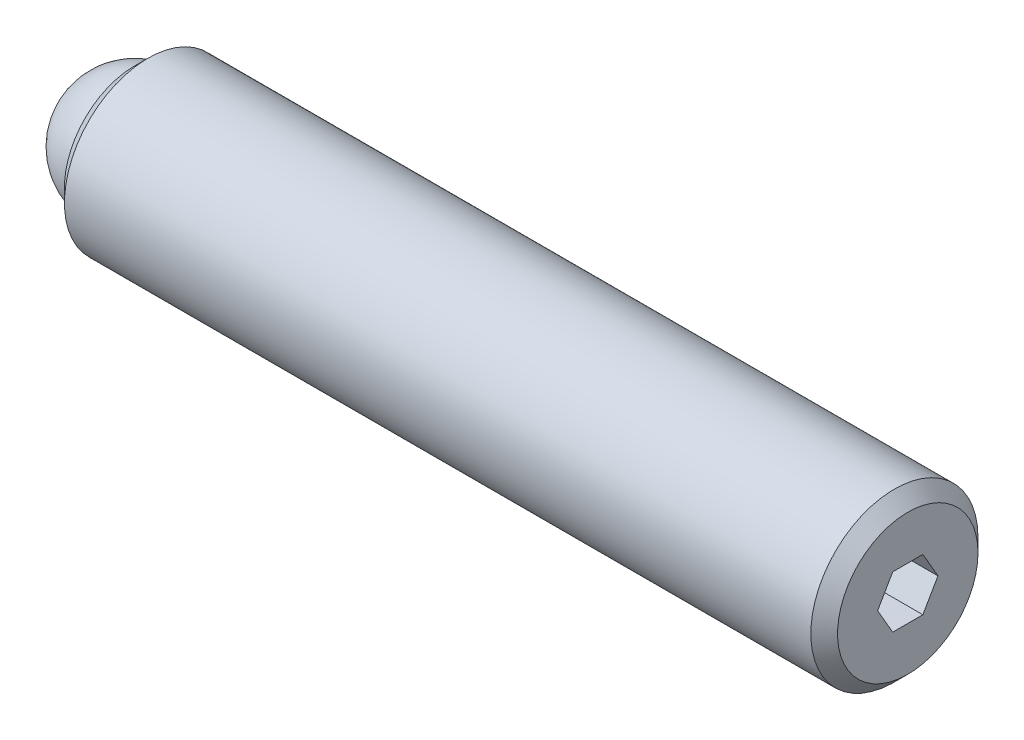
ISO-10303-21;
HEADER;
FILE_DESCRIPTION(('STEP AP214'),'2;1');
FILE_NAME('part.step','',(''),(''),'','','');
FILE_SCHEMA(('AUTOMOTIVE_DESIGN { 1 0 10303 214 1 1 1 1 }'));
ENDSEC;
DATA;
#1=APPLICATION_CONTEXT('core data for automotive mechanical design processes');
#2=APPLICATION_PROTOCOL_DEFINITION('international standard','automotive_design',2000,#1);
#3=PRODUCT_CONTEXT('',#1,'mechanical');
#4=PRODUCT('Part','Part','',(#3));
#5=PRODUCT_RELATED_PRODUCT_CATEGORY('part','',(#4));
#6=PRODUCT_DEFINITION_FORMATION('','',#4);
#7=PRODUCT_DEFINITION_CONTEXT('part definition',#1,'design');
#8=PRODUCT_DEFINITION('design','',#6,#7);
#9=PRODUCT_DEFINITION_SHAPE('','',#8);
#10=(LENGTH_UNIT() NAMED_UNIT(*) SI_UNIT(.MILLI.,.METRE.));
#11=(NAMED_UNIT(*) PLANE_ANGLE_UNIT() SI_UNIT($,.RADIAN.));
#12=(NAMED_UNIT(*) SI_UNIT($,.STERADIAN.) SOLID_ANGLE_UNIT());
#13=UNCERTAINTY_MEASURE_WITH_UNIT(LENGTH_MEASURE(1.E-05),#10,'distance_accuracy_value','');
#14=(GEOMETRIC_REPRESENTATION_CONTEXT(3) GLOBAL_UNCERTAINTY_ASSIGNED_CONTEXT((#13)) GLOBAL_UNIT_ASSIGNED_CONTEXT((#10,
#11,#12)) REPRESENTATION_CONTEXT('',''));
#15=CARTESIAN_POINT('',(0.,0.,0.));
#16=DIRECTION('',(0.,0.,1.));
#17=DIRECTION('',(1.,0.,0.));
#18=AXIS2_PLACEMENT_3D('',#15,#16,#17);
#19=CARTESIAN_POINT('',(0.,0.,0.));
#20=DIRECTION('',(0.,-1.,0.));
#21=DIRECTION('',(0.,0.,1.));
#22=AXIS2_PLACEMENT_3D('',#19,#20,#21);
#23=SPHERICAL_SURFACE('',#22,2.38125);
#24=CARTESIAN_POINT('',(0.,-2.38125,0.));
#25=VERTEX_POINT('',#24);
#26=VERTEX_LOOP('',#25);
#27=FACE_BOUND('',#26,.T.);
#28=ADVANCED_FACE('F41',(#27),#23,.T.);
#29=CLOSED_SHELL('',(#28));
#30=MANIFOLD_SOLID_BREP('B2',#29);
#31=CARTESIAN_POINT('',(29.36875,0.,0.));
#32=DIRECTION('',(-1.,0.,0.));
#33=DIRECTION('',(0.,0.,1.));
#34=AXIS2_PLACEMENT_3D('',#31,#32,#33);
#35=CYLINDRICAL_SURFACE('',#34,3.175);
#36=CARTESIAN_POINT('',(28.86075,0.,0.));
#37=DIRECTION('',(1.,0.,0.));
#38=DIRECTION('',(0.,0.,-1.));
#39=AXIS2_PLACEMENT_3D('',#36,#37,#38);
#40=CIRCLE('',#39,3.175);
#41=CARTESIAN_POINT('',(28.86075,0.,-3.175));
#42=VERTEX_POINT('',#41);
#43=EDGE_CURVE('E39',#42,#42,#40,.F.);
#44=ORIENTED_EDGE('',*,*,#43,.T.);
#45=EDGE_LOOP('',(#44));
#46=FACE_BOUND('',#45,.T.);
#47=CARTESIAN_POINT('',(0.508000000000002,0.,0.));
#48=DIRECTION('',(1.,0.,0.));
#49=DIRECTION('',(0.,0.,-1.));
#50=AXIS2_PLACEMENT_3D('',#47,#48,#49);
#51=CIRCLE('',#50,3.175);
#52=CARTESIAN_POINT('',(0.508000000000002,0.,-3.175));
#53=VERTEX_POINT('',#52);
#54=EDGE_CURVE('E157',#53,#53,#51,.T.);
#55=ORIENTED_EDGE('',*,*,#54,.T.);
#56=EDGE_LOOP('',(#55));
#57=FACE_BOUND('',#56,.T.);
#58=ADVANCED_FACE('F54',(#46,#57),#35,.T.);
#59=CARTESIAN_POINT('',(29.36875,0.,0.));
#60=DIRECTION('',(1.,0.,0.));
#61=DIRECTION('',(0.,0.,-1.));
#62=AXIS2_PLACEMENT_3D('',#59,#60,#61);
#63=PLANE('',#62);
#64=DIRECTION('',(0.,0.866025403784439,-0.5));
#65=VECTOR('',#64,1.);
#66=CARTESIAN_POINT('',(29.36875,-0.9921875,-0.572839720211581));
#67=LINE('',#66,#65);
#68=CARTESIAN_POINT('',(29.36875,-0.9921875,-0.572839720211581));
#69=VERTEX_POINT('',#68);
#70=CARTESIAN_POINT('',(29.36875,0.,-1.14567944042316));
#71=VERTEX_POINT('',#70);
#72=EDGE_CURVE('E69',#69,#71,#67,.T.);
#73=ORIENTED_EDGE('',*,*,#72,.F.);
#74=DIRECTION('',(0.,0.,-1.));
#75=VECTOR('',#74,1.);
#76=CARTESIAN_POINT('',(29.36875,-0.9921875,0.572839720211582));
#77=LINE('',#76,#75);
#78=CARTESIAN_POINT('',(29.36875,-0.9921875,0.572839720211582));
#79=VERTEX_POINT('',#78);
#80=EDGE_CURVE('E153',#79,#69,#77,.T.);
#81=ORIENTED_EDGE('',*,*,#80,.F.);
#82=DIRECTION('',(0.,-0.866025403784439,-0.5));
#83=VECTOR('',#82,1.);
#84=CARTESIAN_POINT('',(29.36875,0.,1.14567944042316));
#85=LINE('',#84,#83);
#86=CARTESIAN_POINT('',(29.36875,0.,1.14567944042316));
#87=VERTEX_POINT('',#86);
#88=EDGE_CURVE('E151',#87,#79,#85,.T.);
#89=ORIENTED_EDGE('',*,*,#88,.F.);
#90=DIRECTION('',(0.,-0.866025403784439,0.5));
#91=VECTOR('',#90,1.);
#92=CARTESIAN_POINT('',(29.36875,0.992187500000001,0.572839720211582));
#93=LINE('',#92,#91);
#94=CARTESIAN_POINT('',(29.36875,0.992187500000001,0.572839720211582));
#95=VERTEX_POINT('',#94);
#96=EDGE_CURVE('E117',#95,#87,#93,.T.);
#97=ORIENTED_EDGE('',*,*,#96,.F.);
#98=DIRECTION('',(0.,0.,1.));
#99=VECTOR('',#98,1.);
#100=CARTESIAN_POINT('',(29.36875,0.9921875,-0.572839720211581));
#101=LINE('',#100,#99);
#102=CARTESIAN_POINT('',(29.36875,0.9921875,-0.572839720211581));
#103=VERTEX_POINT('',#102);
#104=EDGE_CURVE('E147',#103,#95,#101,.T.);
#105=ORIENTED_EDGE('',*,*,#104,.F.);
#106=DIRECTION('',(0.,0.866025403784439,0.5));
#107=VECTOR('',#106,1.);
#108=CARTESIAN_POINT('',(29.36875,0.,-1.14567944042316));
#109=LINE('',#108,#107);
#110=EDGE_CURVE('E143',#71,#103,#109,.T.);
#111=ORIENTED_EDGE('',*,*,#110,.F.);
#112=EDGE_LOOP('',(#73,#81,#89,#97,#105,#111));
#113=FACE_BOUND('',#112,.T.);
#114=CARTESIAN_POINT('',(29.36875,0.,0.));
#115=DIRECTION('',(1.,0.,0.));
#116=DIRECTION('',(0.,0.,-1.));
#117=AXIS2_PLACEMENT_3D('',#114,#115,#116);
#118=CIRCLE('',#117,2.667);
#119=CARTESIAN_POINT('',(29.36875,0.,-2.667));
#120=VERTEX_POINT('',#119);
#121=EDGE_CURVE('E62',#120,#120,#118,.T.);
#122=ORIENTED_EDGE('',*,*,#121,.T.);
#123=EDGE_LOOP('',(#122));
#124=FACE_BOUND('',#123,.T.);
#125=ADVANCED_FACE('F170',(#113,#124),#63,.T.);
#126=CARTESIAN_POINT('',(0.,0.,0.));
#127=DIRECTION('',(1.,0.,0.));
#128=DIRECTION('',(0.,0.,-1.));
#129=AXIS2_PLACEMENT_3D('',#126,#127,#128);
#130=PLANE('',#129);
#131=CARTESIAN_POINT('',(0.,0.,0.));
#132=DIRECTION('',(-1.,0.,0.));
#133=DIRECTION('',(0.,0.,1.));
#134=AXIS2_PLACEMENT_3D('',#131,#132,#133);
#135=CIRCLE('',#134,2.38125);
#136=CARTESIAN_POINT('',(0.,0.,2.38125));
#137=VERTEX_POINT('',#136);
#138=EDGE_CURVE('E225',#137,#137,#135,.T.);
#139=ORIENTED_EDGE('',*,*,#138,.F.);
#140=EDGE_LOOP('',(#139));
#141=FACE_BOUND('',#140,.T.);
#142=CARTESIAN_POINT('',(0.,0.,0.));
#143=DIRECTION('',(1.,0.,0.));
#144=DIRECTION('',(0.,0.,-1.));
#145=AXIS2_PLACEMENT_3D('',#142,#143,#144);
#146=CIRCLE('',#145,2.667);
#147=CARTESIAN_POINT('',(0.,0.,-2.667));
#148=VERTEX_POINT('',#147);
#149=EDGE_CURVE('E165',#148,#148,#146,.F.);
#150=ORIENTED_EDGE('',*,*,#149,.T.);
#151=EDGE_LOOP('',(#150));
#152=FACE_BOUND('',#151,.T.);
#153=ADVANCED_FACE('F182',(#141,#152),#130,.F.);
#154=CARTESIAN_POINT('',(0.508000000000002,0.,0.));
#155=DIRECTION('',(1.,0.,0.));
#156=DIRECTION('',(0.,0.,-1.));
#157=AXIS2_PLACEMENT_3D('',#154,#155,#156);
#158=CONICAL_SURFACE('',#157,3.175,0.785398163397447);
#159=ORIENTED_EDGE('',*,*,#149,.F.);
#160=EDGE_LOOP('',(#159));
#161=FACE_BOUND('',#160,.T.);
#162=ORIENTED_EDGE('',*,*,#54,.F.);
#163=EDGE_LOOP('',(#162));
#164=FACE_BOUND('',#163,.T.);
#165=ADVANCED_FACE('F174',(#161,#164),#158,.T.);
#166=CARTESIAN_POINT('',(29.36875,0.,0.));
#167=DIRECTION('',(-1.,0.,0.));
#168=DIRECTION('',(0.,0.,1.));
#169=AXIS2_PLACEMENT_3D('',#166,#167,#168);
#170=CONICAL_SURFACE('',#169,2.667,0.785398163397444);
#171=ORIENTED_EDGE('',*,*,#43,.F.);
#172=EDGE_LOOP('',(#171));
#173=FACE_BOUND('',#172,.T.);
#174=ORIENTED_EDGE('',*,*,#121,.F.);
#175=EDGE_LOOP('',(#174));
#176=FACE_BOUND('',#175,.T.);
#177=ADVANCED_FACE('F56',(#173,#176),#170,.T.);
#178=CARTESIAN_POINT('',(27.08275,-0.9921875,-0.572839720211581));
#179=DIRECTION('',(0.,-0.5,-0.866025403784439));
#180=DIRECTION('',(0.,0.866025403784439,-0.5));
#181=AXIS2_PLACEMENT_3D('',#178,#179,#180);
#182=PLANE('',#181);
#183=ORIENTED_EDGE('',*,*,#72,.T.);
#184=DIRECTION('',(1.,0.,0.));
#185=VECTOR('',#184,1.);
#186=CARTESIAN_POINT('',(27.08275,0.,-1.14567944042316));
#187=LINE('',#186,#185);
#188=CARTESIAN_POINT('',(27.08275,0.,-1.14567944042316));
#189=VERTEX_POINT('',#188);
#190=EDGE_CURVE('E99',#189,#71,#187,.T.);
#191=ORIENTED_EDGE('',*,*,#190,.F.);
#192=DIRECTION('',(0.,0.866025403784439,-0.5));
#193=VECTOR('',#192,1.);
#194=CARTESIAN_POINT('',(27.08275,-0.9921875,-0.572839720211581));
#195=LINE('',#194,#193);
#196=CARTESIAN_POINT('',(27.08275,-0.9921875,-0.572839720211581));
#197=VERTEX_POINT('',#196);
#198=EDGE_CURVE('E155',#197,#189,#195,.T.);
#199=ORIENTED_EDGE('',*,*,#198,.F.);
#200=DIRECTION('',(1.,0.,0.));
#201=VECTOR('',#200,1.);
#202=CARTESIAN_POINT('',(27.08275,-0.9921875,-0.572839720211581));
#203=LINE('',#202,#201);
#204=EDGE_CURVE('E77',#197,#69,#203,.T.);
#205=ORIENTED_EDGE('',*,*,#204,.T.);
#206=EDGE_LOOP('',(#183,#191,#199,#205));
#207=FACE_BOUND('',#206,.T.);
#208=ADVANCED_FACE('F173',(#207),#182,.F.);
#209=CARTESIAN_POINT('',(27.08275,-0.9921875,0.572839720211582));
#210=DIRECTION('',(0.,-1.,0.));
#211=DIRECTION('',(0.,0.,-1.));
#212=AXIS2_PLACEMENT_3D('',#209,#210,#211);
#213=PLANE('',#212);
#214=ORIENTED_EDGE('',*,*,#80,.T.);
#215=ORIENTED_EDGE('',*,*,#204,.F.);
#216=DIRECTION('',(0.,0.,-1.));
#217=VECTOR('',#216,1.);
#218=CARTESIAN_POINT('',(27.08275,-0.9921875,0.572839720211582));
#219=LINE('',#218,#217);
#220=CARTESIAN_POINT('',(27.08275,-0.9921875,0.572839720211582));
#221=VERTEX_POINT('',#220);
#222=EDGE_CURVE('E129',#221,#197,#219,.T.);
#223=ORIENTED_EDGE('',*,*,#222,.F.);
#224=DIRECTION('',(1.,0.,0.));
#225=VECTOR('',#224,1.);
#226=CARTESIAN_POINT('',(27.08275,-0.9921875,0.572839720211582));
#227=LINE('',#226,#225);
#228=EDGE_CURVE('E121',#221,#79,#227,.T.);
#229=ORIENTED_EDGE('',*,*,#228,.T.);
#230=EDGE_LOOP('',(#214,#215,#223,#229));
#231=FACE_BOUND('',#230,.T.);
#232=ADVANCED_FACE('F180',(#231),#213,.F.);
#233=CARTESIAN_POINT('',(27.08275,0.,1.14567944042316));
#234=DIRECTION('',(0.,-0.5,0.866025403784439));
#235=DIRECTION('',(0.,-0.866025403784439,-0.5));
#236=AXIS2_PLACEMENT_3D('',#233,#234,#235);
#237=PLANE('',#236);
#238=ORIENTED_EDGE('',*,*,#88,.T.);
#239=ORIENTED_EDGE('',*,*,#228,.F.);
#240=DIRECTION('',(0.,-0.866025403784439,-0.5));
#241=VECTOR('',#240,1.);
#242=CARTESIAN_POINT('',(27.08275,0.,1.14567944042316));
#243=LINE('',#242,#241);
#244=CARTESIAN_POINT('',(27.08275,0.,1.14567944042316));
#245=VERTEX_POINT('',#244);
#246=EDGE_CURVE('E125',#245,#221,#243,.T.);
#247=ORIENTED_EDGE('',*,*,#246,.F.);
#248=DIRECTION('',(1.,0.,0.));
#249=VECTOR('',#248,1.);
#250=CARTESIAN_POINT('',(27.08275,0.,1.14567944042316));
#251=LINE('',#250,#249);
#252=EDGE_CURVE('E110',#245,#87,#251,.T.);
#253=ORIENTED_EDGE('',*,*,#252,.T.);
#254=EDGE_LOOP('',(#238,#239,#247,#253));
#255=FACE_BOUND('',#254,.T.);
#256=ADVANCED_FACE('F126',(#255),#237,.F.);
#257=CARTESIAN_POINT('',(27.08275,0.992187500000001,0.572839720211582));
#258=DIRECTION('',(0.,0.5,0.866025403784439));
#259=DIRECTION('',(0.,-0.866025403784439,0.5));
#260=AXIS2_PLACEMENT_3D('',#257,#258,#259);
#261=PLANE('',#260);
#262=ORIENTED_EDGE('',*,*,#96,.T.);
#263=ORIENTED_EDGE('',*,*,#252,.F.);
#264=DIRECTION('',(0.,-0.866025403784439,0.5));
#265=VECTOR('',#264,1.);
#266=CARTESIAN_POINT('',(27.08275,0.992187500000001,0.572839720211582));
#267=LINE('',#266,#265);
#268=CARTESIAN_POINT('',(27.08275,0.992187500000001,0.572839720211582));
#269=VERTEX_POINT('',#268);
#270=EDGE_CURVE('E114',#269,#245,#267,.T.);
#271=ORIENTED_EDGE('',*,*,#270,.F.);
#272=DIRECTION('',(1.,0.,0.));
#273=VECTOR('',#272,1.);
#274=CARTESIAN_POINT('',(27.08275,0.992187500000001,0.572839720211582));
#275=LINE('',#274,#273);
#276=EDGE_CURVE('E122',#269,#95,#275,.T.);
#277=ORIENTED_EDGE('',*,*,#276,.T.);
#278=EDGE_LOOP('',(#262,#263,#271,#277));
#279=FACE_BOUND('',#278,.T.);
#280=ADVANCED_FACE('F112',(#279),#261,.F.);
#281=CARTESIAN_POINT('',(27.08275,0.9921875,-0.572839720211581));
#282=DIRECTION('',(0.,1.,0.));
#283=DIRECTION('',(0.,0.,1.));
#284=AXIS2_PLACEMENT_3D('',#281,#282,#283);
#285=PLANE('',#284);
#286=ORIENTED_EDGE('',*,*,#104,.T.);
#287=ORIENTED_EDGE('',*,*,#276,.F.);
#288=DIRECTION('',(0.,0.,1.));
#289=VECTOR('',#288,1.);
#290=CARTESIAN_POINT('',(27.08275,0.9921875,-0.572839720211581));
#291=LINE('',#290,#289);
#292=CARTESIAN_POINT('',(27.08275,0.9921875,-0.572839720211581));
#293=VERTEX_POINT('',#292);
#294=EDGE_CURVE('E135',#293,#269,#291,.T.);
#295=ORIENTED_EDGE('',*,*,#294,.F.);
#296=DIRECTION('',(1.,0.,0.));
#297=VECTOR('',#296,1.);
#298=CARTESIAN_POINT('',(27.08275,0.9921875,-0.572839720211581));
#299=LINE('',#298,#297);
#300=EDGE_CURVE('E160',#293,#103,#299,.T.);
#301=ORIENTED_EDGE('',*,*,#300,.T.);
#302=EDGE_LOOP('',(#286,#287,#295,#301));
#303=FACE_BOUND('',#302,.T.);
#304=ADVANCED_FACE('F201',(#303),#285,.F.);
#305=CARTESIAN_POINT('',(27.08275,0.,-1.14567944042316));
#306=DIRECTION('',(0.,0.5,-0.866025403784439));
#307=DIRECTION('',(0.,0.866025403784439,0.5));
#308=AXIS2_PLACEMENT_3D('',#305,#306,#307);
#309=PLANE('',#308);
#310=ORIENTED_EDGE('',*,*,#110,.T.);
#311=ORIENTED_EDGE('',*,*,#300,.F.);
#312=DIRECTION('',(0.,0.866025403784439,0.5));
#313=VECTOR('',#312,1.);
#314=CARTESIAN_POINT('',(27.08275,0.,-1.14567944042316));
#315=LINE('',#314,#313);
#316=EDGE_CURVE('E137',#189,#293,#315,.T.);
#317=ORIENTED_EDGE('',*,*,#316,.F.);
#318=ORIENTED_EDGE('',*,*,#190,.T.);
#319=EDGE_LOOP('',(#310,#311,#317,#318));
#320=FACE_BOUND('',#319,.T.);
#321=ADVANCED_FACE('F198',(#320),#309,.F.);
#322=CARTESIAN_POINT('',(27.08275,0.,0.));
#323=DIRECTION('',(1.,0.,0.));
#324=DIRECTION('',(0.,0.,-1.));
#325=AXIS2_PLACEMENT_3D('',#322,#323,#324);
#326=PLANE('',#325);
#327=ORIENTED_EDGE('',*,*,#198,.T.);
#328=ORIENTED_EDGE('',*,*,#316,.T.);
#329=ORIENTED_EDGE('',*,*,#294,.T.);
#330=ORIENTED_EDGE('',*,*,#270,.T.);
#331=ORIENTED_EDGE('',*,*,#246,.T.);
#332=ORIENTED_EDGE('',*,*,#222,.T.);
#333=EDGE_LOOP('',(#327,#328,#329,#330,#331,#332));
#334=FACE_BOUND('',#333,.T.);
#335=ADVANCED_FACE('F132',(#334),#326,.T.);
#336=CARTESIAN_POINT('',(1.984375,0.,0.));
#337=DIRECTION('',(-1.,0.,0.));
#338=DIRECTION('',(0.,0.,1.));
#339=AXIS2_PLACEMENT_3D('',#336,#337,#338);
#340=CYLINDRICAL_SURFACE('',#339,2.38125);
#341=CARTESIAN_POINT('',(1.984375,0.,0.));
#342=DIRECTION('',(-1.,0.,0.));
#343=DIRECTION('',(0.,0.,1.));
#344=AXIS2_PLACEMENT_3D('',#341,#342,#343);
#345=CIRCLE('',#344,2.38125);
#346=CARTESIAN_POINT('',(1.984375,0.,2.38125));
#347=VERTEX_POINT('',#346);
#348=EDGE_CURVE('E144',#347,#347,#345,.T.);
#349=ORIENTED_EDGE('',*,*,#348,.F.);
#350=EDGE_LOOP('',(#349));
#351=FACE_BOUND('',#350,.T.);
#352=ORIENTED_EDGE('',*,*,#138,.T.);
#353=EDGE_LOOP('',(#352));
#354=FACE_BOUND('',#353,.T.);
#355=ADVANCED_FACE('F214',(#351,#354),#340,.F.);
#356=CARTESIAN_POINT('',(1.984375,0.,0.));
#357=DIRECTION('',(-1.,0.,0.));
#358=DIRECTION('',(0.,0.,1.));
#359=AXIS2_PLACEMENT_3D('',#356,#357,#358);
#360=PLANE('',#359);
#361=ORIENTED_EDGE('',*,*,#348,.T.);
#362=EDGE_LOOP('',(#361));
#363=FACE_BOUND('',#362,.T.);
#364=ADVANCED_FACE('F217',(#363),#360,.T.);
#365=CLOSED_SHELL('',(#58,#125,#153,#165,#177,#208,#232,#256,#280,#304,#321,#335,#355,#364));
#366=MANIFOLD_SOLID_BREP('B6',#365);
#367=ADVANCED_BREP_SHAPE_REPRESENTATION('',(#18,#30,#366),#14);
#368=SHAPE_DEFINITION_REPRESENTATION(#9,#367);
ENDSEC;
END-ISO-10303-21;
